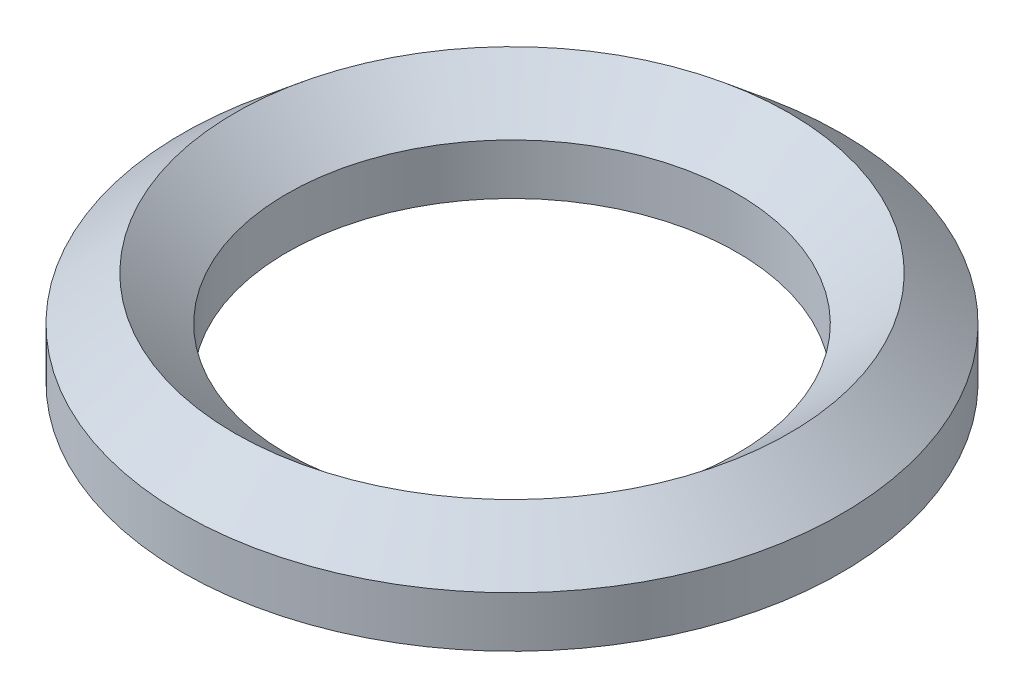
from build123d import *


with BuildPart() as part:
    # Sketch 2 → Revolve 1 (revolve)
    with BuildSketch(Plane(origin=(0, 0, 0), x_dir=(0, 0, -1), z_dir=(1, 0, 0)), mode=Mode.PRIVATE) as revolve_1_sk:
        Polygon((11.1, -4.66068155), (16.25, -4.66068155), (16.25, -2.16068155), (13.675, 0), (11.1, -2.16068155), align=None)
    revolve(revolve_1_sk.sketch.rotate(Axis((0, 2.565563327, 0), (0, -1, 0)), 180), axis=Axis((0, 2.565563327, 0), (0, -1, 0)))


solid = part.part
